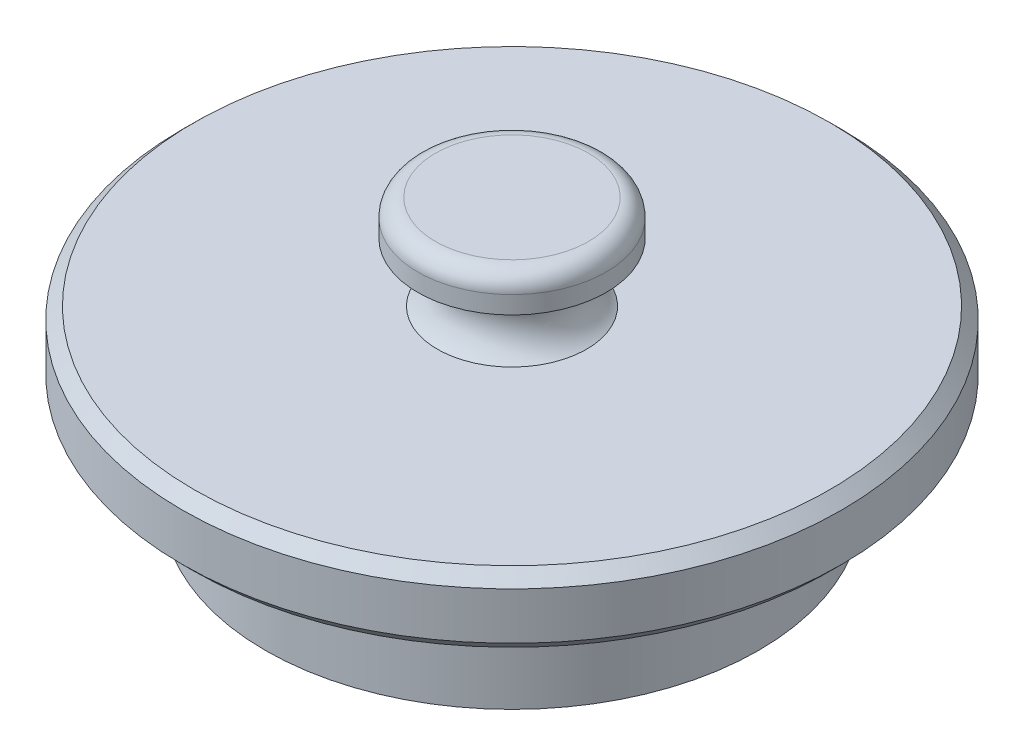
ISO-10303-21;
HEADER;
FILE_DESCRIPTION(('STEP AP214'),'2;1');
FILE_NAME('part.step','',(''),(''),'','','');
FILE_SCHEMA(('AUTOMOTIVE_DESIGN { 1 0 10303 214 1 1 1 1 }'));
ENDSEC;
DATA;
#1=APPLICATION_CONTEXT('core data for automotive mechanical design processes');
#2=APPLICATION_PROTOCOL_DEFINITION('international standard','automotive_design',2000,#1);
#3=PRODUCT_CONTEXT('',#1,'mechanical');
#4=PRODUCT('Part','Part','',(#3));
#5=PRODUCT_RELATED_PRODUCT_CATEGORY('part','',(#4));
#6=PRODUCT_DEFINITION_FORMATION('','',#4);
#7=PRODUCT_DEFINITION_CONTEXT('part definition',#1,'design');
#8=PRODUCT_DEFINITION('design','',#6,#7);
#9=PRODUCT_DEFINITION_SHAPE('','',#8);
#10=(LENGTH_UNIT() NAMED_UNIT(*) SI_UNIT(.MILLI.,.METRE.));
#11=(NAMED_UNIT(*) PLANE_ANGLE_UNIT() SI_UNIT($,.RADIAN.));
#12=(NAMED_UNIT(*) SI_UNIT($,.STERADIAN.) SOLID_ANGLE_UNIT());
#13=UNCERTAINTY_MEASURE_WITH_UNIT(LENGTH_MEASURE(1.E-05),#10,'distance_accuracy_value','');
#14=(GEOMETRIC_REPRESENTATION_CONTEXT(3) GLOBAL_UNCERTAINTY_ASSIGNED_CONTEXT((#13)) GLOBAL_UNIT_ASSIGNED_CONTEXT((#10,
#11,#12)) REPRESENTATION_CONTEXT('',''));
#15=CARTESIAN_POINT('',(0.,0.,0.));
#16=DIRECTION('',(0.,0.,1.));
#17=DIRECTION('',(1.,0.,0.));
#18=AXIS2_PLACEMENT_3D('',#15,#16,#17);
#19=CARTESIAN_POINT('',(-10.4775,0.,0.));
#20=DIRECTION('',(0.,1.,0.));
#21=DIRECTION('',(0.,0.,1.));
#22=AXIS2_PLACEMENT_3D('',#19,#20,#21);
#23=PLANE('',#22);
#24=CARTESIAN_POINT('',(0.,0.,0.));
#25=DIRECTION('',(0.,1.,0.));
#26=DIRECTION('',(0.,0.,1.));
#27=AXIS2_PLACEMENT_3D('',#24,#25,#26);
#28=CIRCLE('',#27,9.47749999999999);
#29=CARTESIAN_POINT('',(0.,0.,9.47749999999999));
#30=VERTEX_POINT('',#29);
#31=EDGE_CURVE('E40',#30,#30,#28,.F.);
#32=ORIENTED_EDGE('',*,*,#31,.T.);
#33=EDGE_LOOP('',(#32));
#34=FACE_BOUND('',#33,.T.);
#35=CARTESIAN_POINT('',(0.,0.,0.));
#36=DIRECTION('',(0.,-1.,0.));
#37=DIRECTION('',(0.,0.,-1.));
#38=AXIS2_PLACEMENT_3D('',#35,#36,#37);
#39=CIRCLE('',#38,7.5);
#40=CARTESIAN_POINT('',(0.,0.,-7.5));
#41=VERTEX_POINT('',#40);
#42=EDGE_CURVE('E53',#41,#41,#39,.T.);
#43=ORIENTED_EDGE('',*,*,#42,.F.);
#44=EDGE_LOOP('',(#43));
#45=FACE_BOUND('',#44,.T.);
#46=ADVANCED_FACE('F34',(#34,#45),#23,.F.);
#47=CARTESIAN_POINT('',(0.,-3.79398642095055,0.));
#48=DIRECTION('',(0.,-1.,0.));
#49=DIRECTION('',(0.,0.,-1.));
#50=AXIS2_PLACEMENT_3D('',#47,#48,#49);
#51=CYLINDRICAL_SURFACE('',#50,10.4775);
#52=CARTESIAN_POINT('',(0.,0.577350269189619,0.));
#53=DIRECTION('',(0.,1.,0.));
#54=DIRECTION('',(0.,0.,1.));
#55=AXIS2_PLACEMENT_3D('',#52,#53,#54);
#56=CIRCLE('',#55,10.4775);
#57=CARTESIAN_POINT('',(0.,0.577350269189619,10.4775));
#58=VERTEX_POINT('',#57);
#59=EDGE_CURVE('E11',#58,#58,#56,.T.);
#60=ORIENTED_EDGE('',*,*,#59,.T.);
#61=EDGE_LOOP('',(#60));
#62=FACE_BOUND('',#61,.T.);
#63=CARTESIAN_POINT('',(0.,5.,0.));
#64=DIRECTION('',(0.,-1.,0.));
#65=DIRECTION('',(0.,0.,-1.));
#66=AXIS2_PLACEMENT_3D('',#63,#64,#65);
#67=CIRCLE('',#66,10.4775);
#68=CARTESIAN_POINT('',(0.,5.,-10.4775));
#69=VERTEX_POINT('',#68);
#70=EDGE_CURVE('E73',#69,#69,#67,.T.);
#71=ORIENTED_EDGE('',*,*,#70,.T.);
#72=EDGE_LOOP('',(#71));
#73=FACE_BOUND('',#72,.T.);
#74=ADVANCED_FACE('F104',(#62,#73),#51,.T.);
#75=CARTESIAN_POINT('',(-14.,5.,0.));
#76=DIRECTION('',(0.,1.,0.));
#77=DIRECTION('',(0.,0.,1.));
#78=AXIS2_PLACEMENT_3D('',#75,#76,#77);
#79=PLANE('',#78);
#80=CARTESIAN_POINT('',(0.,5.,0.));
#81=DIRECTION('',(0.,1.,0.));
#82=DIRECTION('',(0.,0.,1.));
#83=AXIS2_PLACEMENT_3D('',#80,#81,#82);
#84=CIRCLE('',#83,13.5);
#85=CARTESIAN_POINT('',(0.,5.,13.5));
#86=VERTEX_POINT('',#85);
#87=EDGE_CURVE('E85',#86,#86,#84,.F.);
#88=ORIENTED_EDGE('',*,*,#87,.T.);
#89=EDGE_LOOP('',(#88));
#90=FACE_BOUND('',#89,.T.);
#91=ORIENTED_EDGE('',*,*,#70,.F.);
#92=EDGE_LOOP('',(#91));
#93=FACE_BOUND('',#92,.T.);
#94=ADVANCED_FACE('F108',(#90,#93),#79,.F.);
#95=CARTESIAN_POINT('',(0.,-3.79398642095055,0.));
#96=DIRECTION('',(0.,-1.,0.));
#97=DIRECTION('',(0.,0.,-1.));
#98=AXIS2_PLACEMENT_3D('',#95,#96,#97);
#99=CYLINDRICAL_SURFACE('',#98,14.);
#100=CARTESIAN_POINT('',(0.,7.49999999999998,0.));
#101=DIRECTION('',(0.,-1.,0.));
#102=DIRECTION('',(0.,0.,-1.));
#103=AXIS2_PLACEMENT_3D('',#100,#101,#102);
#104=CIRCLE('',#103,14.);
#105=CARTESIAN_POINT('',(0.,7.49999999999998,-14.));
#106=VERTEX_POINT('',#105);
#107=EDGE_CURVE('E79',#106,#106,#104,.T.);
#108=ORIENTED_EDGE('',*,*,#107,.T.);
#109=EDGE_LOOP('',(#108));
#110=FACE_BOUND('',#109,.T.);
#111=CARTESIAN_POINT('',(0.,5.50000000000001,0.));
#112=DIRECTION('',(0.,1.,0.));
#113=DIRECTION('',(0.,0.,1.));
#114=AXIS2_PLACEMENT_3D('',#111,#112,#113);
#115=CIRCLE('',#114,14.);
#116=CARTESIAN_POINT('',(0.,5.50000000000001,14.));
#117=VERTEX_POINT('',#116);
#118=EDGE_CURVE('E76',#117,#117,#115,.T.);
#119=ORIENTED_EDGE('',*,*,#118,.T.);
#120=EDGE_LOOP('',(#119));
#121=FACE_BOUND('',#120,.T.);
#122=ADVANCED_FACE('F113',(#110,#121),#99,.T.);
#123=CARTESIAN_POINT('',(-3.17084380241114,7.99999999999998,0.));
#124=DIRECTION('',(0.,-1.,0.));
#125=DIRECTION('',(0.,0.,-1.));
#126=AXIS2_PLACEMENT_3D('',#123,#124,#125);
#127=PLANE('',#126);
#128=CARTESIAN_POINT('',(0.,7.99999999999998,0.));
#129=DIRECTION('',(0.,-1.,0.));
#130=DIRECTION('',(0.,0.,-1.));
#131=AXIS2_PLACEMENT_3D('',#128,#129,#130);
#132=CIRCLE('',#131,13.5);
#133=CARTESIAN_POINT('',(0.,7.99999999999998,-13.5));
#134=VERTEX_POINT('',#133);
#135=EDGE_CURVE('E82',#134,#134,#132,.F.);
#136=ORIENTED_EDGE('',*,*,#135,.T.);
#137=EDGE_LOOP('',(#136));
#138=FACE_BOUND('',#137,.T.);
#139=CARTESIAN_POINT('',(0.,8.00000000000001,0.));
#140=DIRECTION('',(0.,-1.,0.));
#141=DIRECTION('',(0.,0.,-1.));
#142=AXIS2_PLACEMENT_3D('',#139,#140,#141);
#143=CIRCLE('',#142,3.17084380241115);
#144=CARTESIAN_POINT('',(0.,8.00000000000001,-3.17084380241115));
#145=VERTEX_POINT('',#144);
#146=EDGE_CURVE('E70',#145,#145,#143,.T.);
#147=ORIENTED_EDGE('',*,*,#146,.T.);
#148=EDGE_LOOP('',(#147));
#149=FACE_BOUND('',#148,.T.);
#150=ADVANCED_FACE('F120',(#138,#149),#127,.F.);
#151=CARTESIAN_POINT('',(0.,9.24999999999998,0.));
#152=DIRECTION('',(0.,-1.,0.));
#153=DIRECTION('',(0.,0.,-1.));
#154=AXIS2_PLACEMENT_3D('',#151,#152,#153);
#155=TOROIDAL_SURFACE('',#154,4.,1.5);
#156=ORIENTED_EDGE('',*,*,#146,.F.);
#157=EDGE_LOOP('',(#156));
#158=FACE_BOUND('',#157,.T.);
#159=CARTESIAN_POINT('',(0.,10.5,0.));
#160=DIRECTION('',(0.,-1.,0.));
#161=DIRECTION('',(0.,0.,-1.));
#162=AXIS2_PLACEMENT_3D('',#159,#160,#161);
#163=CIRCLE('',#162,3.17084380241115);
#164=CARTESIAN_POINT('',(0.,10.5,-3.17084380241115));
#165=VERTEX_POINT('',#164);
#166=EDGE_CURVE('E67',#165,#165,#163,.T.);
#167=ORIENTED_EDGE('',*,*,#166,.T.);
#168=EDGE_LOOP('',(#167));
#169=FACE_BOUND('',#168,.T.);
#170=ADVANCED_FACE('F124',(#158,#169),#155,.F.);
#171=CARTESIAN_POINT('',(-4.,10.5,0.));
#172=DIRECTION('',(0.,1.,0.));
#173=DIRECTION('',(0.,0.,1.));
#174=AXIS2_PLACEMENT_3D('',#171,#172,#173);
#175=PLANE('',#174);
#176=ORIENTED_EDGE('',*,*,#166,.F.);
#177=EDGE_LOOP('',(#176));
#178=FACE_BOUND('',#177,.T.);
#179=CARTESIAN_POINT('',(0.,10.5,0.));
#180=DIRECTION('',(0.,-1.,0.));
#181=DIRECTION('',(0.,0.,-1.));
#182=AXIS2_PLACEMENT_3D('',#179,#180,#181);
#183=CIRCLE('',#182,4.);
#184=CARTESIAN_POINT('',(0.,10.5,-4.));
#185=VERTEX_POINT('',#184);
#186=EDGE_CURVE('E64',#185,#185,#183,.T.);
#187=ORIENTED_EDGE('',*,*,#186,.T.);
#188=EDGE_LOOP('',(#187));
#189=FACE_BOUND('',#188,.T.);
#190=ADVANCED_FACE('F128',(#178,#189),#175,.F.);
#191=CARTESIAN_POINT('',(0.,-3.79398642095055,0.));
#192=DIRECTION('',(0.,-1.,0.));
#193=DIRECTION('',(0.,0.,-1.));
#194=AXIS2_PLACEMENT_3D('',#191,#192,#193);
#195=CYLINDRICAL_SURFACE('',#194,4.);
#196=ORIENTED_EDGE('',*,*,#186,.F.);
#197=EDGE_LOOP('',(#196));
#198=FACE_BOUND('',#197,.T.);
#199=CARTESIAN_POINT('',(0.,11.25,0.));
#200=DIRECTION('',(0.,-1.,0.));
#201=DIRECTION('',(0.,0.,-1.));
#202=AXIS2_PLACEMENT_3D('',#199,#200,#201);
#203=CIRCLE('',#202,4.);
#204=CARTESIAN_POINT('',(0.,11.25,-4.));
#205=VERTEX_POINT('',#204);
#206=EDGE_CURVE('E61',#205,#205,#203,.T.);
#207=ORIENTED_EDGE('',*,*,#206,.T.);
#208=EDGE_LOOP('',(#207));
#209=FACE_BOUND('',#208,.T.);
#210=ADVANCED_FACE('F132',(#198,#209),#195,.T.);
#211=CARTESIAN_POINT('',(0.,11.25,0.));
#212=DIRECTION('',(0.,-1.,0.));
#213=DIRECTION('',(0.,0.,-1.));
#214=AXIS2_PLACEMENT_3D('',#211,#212,#213);
#215=TOROIDAL_SURFACE('',#214,3.25,0.75);
#216=ORIENTED_EDGE('',*,*,#206,.F.);
#217=EDGE_LOOP('',(#216));
#218=FACE_BOUND('',#217,.T.);
#219=CARTESIAN_POINT('',(0.,12.,0.));
#220=DIRECTION('',(0.,-1.,0.));
#221=DIRECTION('',(0.,0.,-1.));
#222=AXIS2_PLACEMENT_3D('',#219,#220,#221);
#223=CIRCLE('',#222,3.24999999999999);
#224=CARTESIAN_POINT('',(0.,12.,-3.24999999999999));
#225=VERTEX_POINT('',#224);
#226=EDGE_CURVE('E56',#225,#225,#223,.T.);
#227=ORIENTED_EDGE('',*,*,#226,.T.);
#228=EDGE_LOOP('',(#227));
#229=FACE_BOUND('',#228,.T.);
#230=ADVANCED_FACE('F136',(#218,#229),#215,.T.);
#231=CARTESIAN_POINT('',(0.,12.,0.));
#232=DIRECTION('',(0.,-1.,0.));
#233=DIRECTION('',(0.,0.,-1.));
#234=AXIS2_PLACEMENT_3D('',#231,#232,#233);
#235=PLANE('',#234);
#236=ORIENTED_EDGE('',*,*,#226,.F.);
#237=EDGE_LOOP('',(#236));
#238=FACE_BOUND('',#237,.T.);
#239=ADVANCED_FACE('F140',(#238),#235,.F.);
#240=CARTESIAN_POINT('',(0.,0.,0.));
#241=DIRECTION('',(0.,-1.,0.));
#242=DIRECTION('',(0.,0.,-1.));
#243=AXIS2_PLACEMENT_3D('',#240,#241,#242);
#244=CYLINDRICAL_SURFACE('',#243,7.5);
#245=CARTESIAN_POINT('',(0.,3.,0.));
#246=DIRECTION('',(0.,-1.,0.));
#247=DIRECTION('',(0.,0.,-1.));
#248=AXIS2_PLACEMENT_3D('',#245,#246,#247);
#249=CIRCLE('',#248,7.5);
#250=CARTESIAN_POINT('',(0.,3.,-7.5));
#251=VERTEX_POINT('',#250);
#252=EDGE_CURVE('E51',#251,#251,#249,.T.);
#253=ORIENTED_EDGE('',*,*,#252,.F.);
#254=EDGE_LOOP('',(#253));
#255=FACE_BOUND('',#254,.T.);
#256=ORIENTED_EDGE('',*,*,#42,.T.);
#257=EDGE_LOOP('',(#256));
#258=FACE_BOUND('',#257,.T.);
#259=ADVANCED_FACE('F47',(#255,#258),#244,.F.);
#260=CARTESIAN_POINT('',(0.,3.,0.));
#261=DIRECTION('',(0.,-1.,0.));
#262=DIRECTION('',(0.,0.,-1.));
#263=AXIS2_PLACEMENT_3D('',#260,#261,#262);
#264=CONICAL_SURFACE('',#263,7.5,1.02974425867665);
#265=CARTESIAN_POINT('',(0.,7.50645464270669,0.));
#266=VERTEX_POINT('',#265);
#267=VERTEX_LOOP('',#266);
#268=FACE_BOUND('',#267,.T.);
#269=ORIENTED_EDGE('',*,*,#252,.T.);
#270=EDGE_LOOP('',(#269));
#271=FACE_BOUND('',#270,.T.);
#272=ADVANCED_FACE('F43',(#268,#271),#264,.F.);
#273=CARTESIAN_POINT('',(0.,7.49999999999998,0.));
#274=DIRECTION('',(0.,-1.,0.));
#275=DIRECTION('',(0.,0.,-1.));
#276=AXIS2_PLACEMENT_3D('',#273,#274,#275);
#277=CONICAL_SURFACE('',#276,14.,0.785398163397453);
#278=ORIENTED_EDGE('',*,*,#135,.F.);
#279=EDGE_LOOP('',(#278));
#280=FACE_BOUND('',#279,.T.);
#281=ORIENTED_EDGE('',*,*,#107,.F.);
#282=EDGE_LOOP('',(#281));
#283=FACE_BOUND('',#282,.T.);
#284=ADVANCED_FACE('F46',(#280,#283),#277,.T.);
#285=CARTESIAN_POINT('',(0.,5.,0.));
#286=DIRECTION('',(0.,1.,0.));
#287=DIRECTION('',(0.,0.,1.));
#288=AXIS2_PLACEMENT_3D('',#285,#286,#287);
#289=CONICAL_SURFACE('',#288,13.5,0.785398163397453);
#290=ORIENTED_EDGE('',*,*,#118,.F.);
#291=EDGE_LOOP('',(#290));
#292=FACE_BOUND('',#291,.T.);
#293=ORIENTED_EDGE('',*,*,#87,.F.);
#294=EDGE_LOOP('',(#293));
#295=FACE_BOUND('',#294,.T.);
#296=ADVANCED_FACE('F94',(#292,#295),#289,.T.);
#297=CARTESIAN_POINT('',(0.,0.,0.));
#298=DIRECTION('',(0.,1.,0.));
#299=DIRECTION('',(0.,0.,1.));
#300=AXIS2_PLACEMENT_3D('',#297,#298,#299);
#301=CONICAL_SURFACE('',#300,9.47749999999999,1.0471975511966);
#302=ORIENTED_EDGE('',*,*,#59,.F.);
#303=EDGE_LOOP('',(#302));
#304=FACE_BOUND('',#303,.T.);
#305=ORIENTED_EDGE('',*,*,#31,.F.);
#306=EDGE_LOOP('',(#305));
#307=FACE_BOUND('',#306,.T.);
#308=ADVANCED_FACE('F92',(#304,#307),#301,.T.);
#309=CLOSED_SHELL('',(#46,#74,#94,#122,#150,#170,#190,#210,#230,#239,#259,#272,#284,#296,#308));
#310=MANIFOLD_SOLID_BREP('B2',#309);
#311=ADVANCED_BREP_SHAPE_REPRESENTATION('',(#18,#310),#14);
#312=SHAPE_DEFINITION_REPRESENTATION(#9,#311);
ENDSEC;
END-ISO-10303-21;
